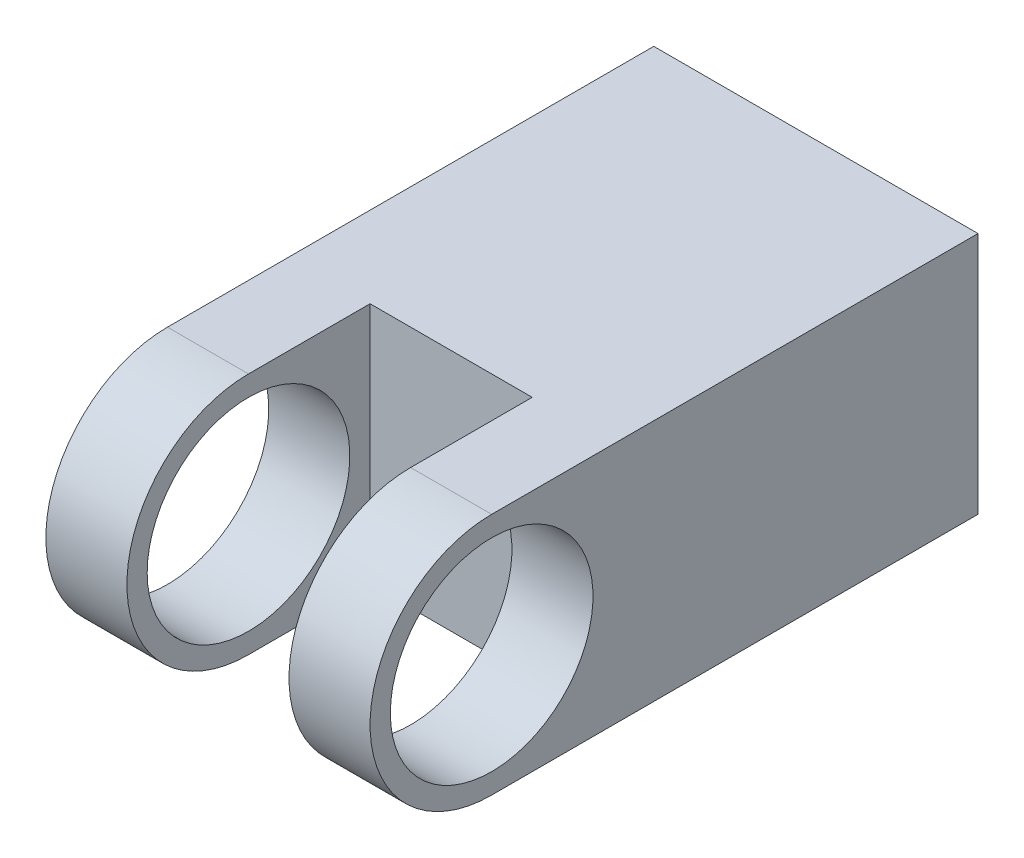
ISO-10303-21;
HEADER;
FILE_DESCRIPTION(('STEP AP214'),'2;1');
FILE_NAME('part.step','',(''),(''),'','','');
FILE_SCHEMA(('AUTOMOTIVE_DESIGN { 1 0 10303 214 1 1 1 1 }'));
ENDSEC;
DATA;
#1=APPLICATION_CONTEXT('core data for automotive mechanical design processes');
#2=APPLICATION_PROTOCOL_DEFINITION('international standard','automotive_design',2000,#1);
#3=PRODUCT_CONTEXT('',#1,'mechanical');
#4=PRODUCT('Part','Part','',(#3));
#5=PRODUCT_RELATED_PRODUCT_CATEGORY('part','',(#4));
#6=PRODUCT_DEFINITION_FORMATION('','',#4);
#7=PRODUCT_DEFINITION_CONTEXT('part definition',#1,'design');
#8=PRODUCT_DEFINITION('design','',#6,#7);
#9=PRODUCT_DEFINITION_SHAPE('','',#8);
#10=(LENGTH_UNIT() NAMED_UNIT(*) SI_UNIT(.MILLI.,.METRE.));
#11=(NAMED_UNIT(*) PLANE_ANGLE_UNIT() SI_UNIT($,.RADIAN.));
#12=(NAMED_UNIT(*) SI_UNIT($,.STERADIAN.) SOLID_ANGLE_UNIT());
#13=UNCERTAINTY_MEASURE_WITH_UNIT(LENGTH_MEASURE(1.E-05),#10,'distance_accuracy_value','');
#14=(GEOMETRIC_REPRESENTATION_CONTEXT(3) GLOBAL_UNCERTAINTY_ASSIGNED_CONTEXT((#13)) GLOBAL_UNIT_ASSIGNED_CONTEXT((#10,
#11,#12)) REPRESENTATION_CONTEXT('',''));
#15=CARTESIAN_POINT('',(0.,0.,0.));
#16=DIRECTION('',(0.,0.,1.));
#17=DIRECTION('',(1.,0.,0.));
#18=AXIS2_PLACEMENT_3D('',#15,#16,#17);
#19=CARTESIAN_POINT('',(0.,30.,0.));
#20=DIRECTION('',(1.,0.,0.));
#21=DIRECTION('',(0.,0.,-1.));
#22=AXIS2_PLACEMENT_3D('',#19,#20,#21);
#23=PLANE('',#22);
#24=DIRECTION('',(0.,0.,1.));
#25=VECTOR('',#24,1.);
#26=CARTESIAN_POINT('',(0.,0.,0.));
#27=LINE('',#26,#25);
#28=CARTESIAN_POINT('',(0.,0.,-45.));
#29=VERTEX_POINT('',#28);
#30=CARTESIAN_POINT('',(0.,0.,15.));
#31=VERTEX_POINT('',#30);
#32=EDGE_CURVE('E152',#29,#31,#27,.T.);
#33=ORIENTED_EDGE('',*,*,#32,.T.);
#34=CARTESIAN_POINT('',(0.,15.,15.));
#35=DIRECTION('',(-1.,0.,0.));
#36=DIRECTION('',(0.,0.,-1.));
#37=AXIS2_PLACEMENT_3D('',#34,#35,#36);
#38=CIRCLE('',#37,15.);
#39=CARTESIAN_POINT('',(0.,30.,15.));
#40=VERTEX_POINT('',#39);
#41=EDGE_CURVE('E133',#31,#40,#38,.T.);
#42=ORIENTED_EDGE('',*,*,#41,.T.);
#43=DIRECTION('',(0.,0.,1.));
#44=VECTOR('',#43,1.);
#45=CARTESIAN_POINT('',(0.,30.,0.));
#46=LINE('',#45,#44);
#47=CARTESIAN_POINT('',(0.,30.,-45.));
#48=VERTEX_POINT('',#47);
#49=EDGE_CURVE('E155',#48,#40,#46,.T.);
#50=ORIENTED_EDGE('',*,*,#49,.F.);
#51=DIRECTION('',(0.,-1.,0.));
#52=VECTOR('',#51,1.);
#53=CARTESIAN_POINT('',(0.,30.,-45.));
#54=LINE('',#53,#52);
#55=EDGE_CURVE('E40',#48,#29,#54,.T.);
#56=ORIENTED_EDGE('',*,*,#55,.T.);
#57=EDGE_LOOP('',(#33,#42,#50,#56));
#58=FACE_BOUND('',#57,.T.);
#59=CARTESIAN_POINT('',(0.,15.,15.));
#60=DIRECTION('',(-1.,0.,0.));
#61=DIRECTION('',(0.,0.,1.));
#62=AXIS2_PLACEMENT_3D('',#59,#60,#61);
#63=CIRCLE('',#62,12.5);
#64=CARTESIAN_POINT('',(0.,15.,27.5));
#65=VERTEX_POINT('',#64);
#66=EDGE_CURVE('E128',#65,#65,#63,.T.);
#67=ORIENTED_EDGE('',*,*,#66,.F.);
#68=EDGE_LOOP('',(#67));
#69=FACE_BOUND('',#68,.T.);
#70=ADVANCED_FACE('F33',(#58,#69),#23,.F.);
#71=CARTESIAN_POINT('',(0.,30.,0.));
#72=DIRECTION('',(0.,0.,-1.));
#73=DIRECTION('',(-1.,0.,0.));
#74=AXIS2_PLACEMENT_3D('',#71,#72,#73);
#75=PLANE('',#74);
#76=DIRECTION('',(1.,0.,0.));
#77=VECTOR('',#76,1.);
#78=CARTESIAN_POINT('',(0.,0.,0.));
#79=LINE('',#78,#77);
#80=CARTESIAN_POINT('',(10.,0.,0.));
#81=VERTEX_POINT('',#80);
#82=CARTESIAN_POINT('',(30.,0.,0.));
#83=VERTEX_POINT('',#82);
#84=EDGE_CURVE('E52',#81,#83,#79,.T.);
#85=ORIENTED_EDGE('',*,*,#84,.T.);
#86=DIRECTION('',(0.,-1.,0.));
#87=VECTOR('',#86,1.);
#88=CARTESIAN_POINT('',(30.,30.,0.));
#89=LINE('',#88,#87);
#90=CARTESIAN_POINT('',(30.,30.,0.));
#91=VERTEX_POINT('',#90);
#92=EDGE_CURVE('E47',#91,#83,#89,.T.);
#93=ORIENTED_EDGE('',*,*,#92,.F.);
#94=DIRECTION('',(1.,0.,0.));
#95=VECTOR('',#94,1.);
#96=CARTESIAN_POINT('',(0.,30.,0.));
#97=LINE('',#96,#95);
#98=CARTESIAN_POINT('',(10.,30.,0.));
#99=VERTEX_POINT('',#98);
#100=EDGE_CURVE('E120',#99,#91,#97,.T.);
#101=ORIENTED_EDGE('',*,*,#100,.F.);
#102=DIRECTION('',(0.,-1.,0.));
#103=VECTOR('',#102,1.);
#104=CARTESIAN_POINT('',(10.,30.,0.));
#105=LINE('',#104,#103);
#106=EDGE_CURVE('E136',#99,#81,#105,.T.);
#107=ORIENTED_EDGE('',*,*,#106,.T.);
#108=EDGE_LOOP('',(#85,#93,#101,#107));
#109=FACE_BOUND('',#108,.T.);
#110=ADVANCED_FACE('F189',(#109),#75,.F.);
#111=CARTESIAN_POINT('',(40.,30.,0.));
#112=DIRECTION('',(-1.,0.,0.));
#113=DIRECTION('',(0.,0.,1.));
#114=AXIS2_PLACEMENT_3D('',#111,#112,#113);
#115=PLANE('',#114);
#116=DIRECTION('',(0.,0.,-1.));
#117=VECTOR('',#116,1.);
#118=CARTESIAN_POINT('',(40.,0.,0.));
#119=LINE('',#118,#117);
#120=CARTESIAN_POINT('',(40.,0.,15.));
#121=VERTEX_POINT('',#120);
#122=CARTESIAN_POINT('',(40.,0.,-45.));
#123=VERTEX_POINT('',#122);
#124=EDGE_CURVE('E165',#121,#123,#119,.T.);
#125=ORIENTED_EDGE('',*,*,#124,.T.);
#126=DIRECTION('',(0.,-1.,0.));
#127=VECTOR('',#126,1.);
#128=CARTESIAN_POINT('',(40.,30.,-45.));
#129=LINE('',#128,#127);
#130=CARTESIAN_POINT('',(40.,30.,-45.));
#131=VERTEX_POINT('',#130);
#132=EDGE_CURVE('E11',#131,#123,#129,.T.);
#133=ORIENTED_EDGE('',*,*,#132,.F.);
#134=DIRECTION('',(0.,0.,-1.));
#135=VECTOR('',#134,1.);
#136=CARTESIAN_POINT('',(40.,30.,0.));
#137=LINE('',#136,#135);
#138=CARTESIAN_POINT('',(40.,30.,15.));
#139=VERTEX_POINT('',#138);
#140=EDGE_CURVE('E159',#139,#131,#137,.T.);
#141=ORIENTED_EDGE('',*,*,#140,.F.);
#142=CARTESIAN_POINT('',(40.,15.,15.));
#143=DIRECTION('',(-1.,0.,0.));
#144=DIRECTION('',(0.,0.,-1.));
#145=AXIS2_PLACEMENT_3D('',#142,#143,#144);
#146=CIRCLE('',#145,15.);
#147=EDGE_CURVE('E114',#121,#139,#146,.T.);
#148=ORIENTED_EDGE('',*,*,#147,.F.);
#149=EDGE_LOOP('',(#125,#133,#141,#148));
#150=FACE_BOUND('',#149,.T.);
#151=CARTESIAN_POINT('',(40.,15.,15.));
#152=DIRECTION('',(-1.,0.,0.));
#153=DIRECTION('',(0.,0.,1.));
#154=AXIS2_PLACEMENT_3D('',#151,#152,#153);
#155=CIRCLE('',#154,12.5);
#156=CARTESIAN_POINT('',(40.,15.,27.5));
#157=VERTEX_POINT('',#156);
#158=EDGE_CURVE('E193',#157,#157,#155,.T.);
#159=ORIENTED_EDGE('',*,*,#158,.T.);
#160=EDGE_LOOP('',(#159));
#161=FACE_BOUND('',#160,.T.);
#162=ADVANCED_FACE('F186',(#150,#161),#115,.F.);
#163=CARTESIAN_POINT('',(0.,30.,-45.));
#164=DIRECTION('',(0.,0.,1.));
#165=DIRECTION('',(1.,0.,0.));
#166=AXIS2_PLACEMENT_3D('',#163,#164,#165);
#167=PLANE('',#166);
#168=DIRECTION('',(-1.,0.,0.));
#169=VECTOR('',#168,1.);
#170=CARTESIAN_POINT('',(0.,0.,-45.));
#171=LINE('',#170,#169);
#172=EDGE_CURVE('E157',#123,#29,#171,.T.);
#173=ORIENTED_EDGE('',*,*,#172,.T.);
#174=ORIENTED_EDGE('',*,*,#55,.F.);
#175=DIRECTION('',(-1.,0.,0.));
#176=VECTOR('',#175,1.);
#177=CARTESIAN_POINT('',(0.,30.,-45.));
#178=LINE('',#177,#176);
#179=EDGE_CURVE('E161',#131,#48,#178,.T.);
#180=ORIENTED_EDGE('',*,*,#179,.F.);
#181=ORIENTED_EDGE('',*,*,#132,.T.);
#182=EDGE_LOOP('',(#173,#174,#180,#181));
#183=FACE_BOUND('',#182,.T.);
#184=ADVANCED_FACE('F184',(#183),#167,.F.);
#185=CARTESIAN_POINT('',(0.,30.,0.));
#186=DIRECTION('',(0.,-1.,0.));
#187=DIRECTION('',(0.,0.,-1.));
#188=AXIS2_PLACEMENT_3D('',#185,#186,#187);
#189=PLANE('',#188);
#190=ORIENTED_EDGE('',*,*,#49,.T.);
#191=DIRECTION('',(-1.,0.,0.));
#192=VECTOR('',#191,1.);
#193=CARTESIAN_POINT('',(10.,30.,15.));
#194=LINE('',#193,#192);
#195=CARTESIAN_POINT('',(10.,30.,15.));
#196=VERTEX_POINT('',#195);
#197=EDGE_CURVE('E149',#196,#40,#194,.T.);
#198=ORIENTED_EDGE('',*,*,#197,.F.);
#199=DIRECTION('',(0.,0.,-1.));
#200=VECTOR('',#199,1.);
#201=CARTESIAN_POINT('',(10.,30.,0.));
#202=LINE('',#201,#200);
#203=EDGE_CURVE('E144',#196,#99,#202,.T.);
#204=ORIENTED_EDGE('',*,*,#203,.T.);
#205=ORIENTED_EDGE('',*,*,#100,.T.);
#206=DIRECTION('',(0.,0.,-1.));
#207=VECTOR('',#206,1.);
#208=CARTESIAN_POINT('',(30.,30.,0.));
#209=LINE('',#208,#207);
#210=CARTESIAN_POINT('',(30.,30.,15.));
#211=VERTEX_POINT('',#210);
#212=EDGE_CURVE('E103',#211,#91,#209,.T.);
#213=ORIENTED_EDGE('',*,*,#212,.F.);
#214=DIRECTION('',(1.,0.,0.));
#215=VECTOR('',#214,1.);
#216=CARTESIAN_POINT('',(30.,30.,15.));
#217=LINE('',#216,#215);
#218=EDGE_CURVE('E111',#211,#139,#217,.T.);
#219=ORIENTED_EDGE('',*,*,#218,.T.);
#220=ORIENTED_EDGE('',*,*,#140,.T.);
#221=ORIENTED_EDGE('',*,*,#179,.T.);
#222=EDGE_LOOP('',(#190,#198,#204,#205,#213,#219,#220,#221));
#223=FACE_BOUND('',#222,.T.);
#224=ADVANCED_FACE('F118',(#223),#189,.F.);
#225=CARTESIAN_POINT('',(0.,0.,0.));
#226=DIRECTION('',(0.,-1.,0.));
#227=DIRECTION('',(0.,0.,-1.));
#228=AXIS2_PLACEMENT_3D('',#225,#226,#227);
#229=PLANE('',#228);
#230=ORIENTED_EDGE('',*,*,#32,.F.);
#231=ORIENTED_EDGE('',*,*,#172,.F.);
#232=ORIENTED_EDGE('',*,*,#124,.F.);
#233=DIRECTION('',(1.,0.,0.));
#234=VECTOR('',#233,1.);
#235=CARTESIAN_POINT('',(30.,0.,15.));
#236=LINE('',#235,#234);
#237=CARTESIAN_POINT('',(30.,0.,15.));
#238=VERTEX_POINT('',#237);
#239=EDGE_CURVE('E116',#238,#121,#236,.T.);
#240=ORIENTED_EDGE('',*,*,#239,.F.);
#241=DIRECTION('',(0.,0.,1.));
#242=VECTOR('',#241,1.);
#243=CARTESIAN_POINT('',(30.,0.,15.));
#244=LINE('',#243,#242);
#245=EDGE_CURVE('E104',#83,#238,#244,.T.);
#246=ORIENTED_EDGE('',*,*,#245,.F.);
#247=ORIENTED_EDGE('',*,*,#84,.F.);
#248=DIRECTION('',(0.,0.,1.));
#249=VECTOR('',#248,1.);
#250=CARTESIAN_POINT('',(10.,0.,15.));
#251=LINE('',#250,#249);
#252=CARTESIAN_POINT('',(10.,0.,15.));
#253=VERTEX_POINT('',#252);
#254=EDGE_CURVE('E138',#81,#253,#251,.T.);
#255=ORIENTED_EDGE('',*,*,#254,.T.);
#256=DIRECTION('',(-1.,0.,0.));
#257=VECTOR('',#256,1.);
#258=CARTESIAN_POINT('',(10.,0.,15.));
#259=LINE('',#258,#257);
#260=EDGE_CURVE('E146',#253,#31,#259,.T.);
#261=ORIENTED_EDGE('',*,*,#260,.T.);
#262=EDGE_LOOP('',(#230,#231,#232,#240,#246,#247,#255,#261));
#263=FACE_BOUND('',#262,.T.);
#264=ADVANCED_FACE('F177',(#263),#229,.T.);
#265=CARTESIAN_POINT('',(10.,15.,15.));
#266=DIRECTION('',(-1.,0.,0.));
#267=DIRECTION('',(0.,0.,1.));
#268=AXIS2_PLACEMENT_3D('',#265,#266,#267);
#269=CYLINDRICAL_SURFACE('',#268,15.);
#270=ORIENTED_EDGE('',*,*,#41,.F.);
#271=ORIENTED_EDGE('',*,*,#260,.F.);
#272=CARTESIAN_POINT('',(10.,15.,15.));
#273=DIRECTION('',(-1.,0.,0.));
#274=DIRECTION('',(0.,0.,-1.));
#275=AXIS2_PLACEMENT_3D('',#272,#273,#274);
#276=CIRCLE('',#275,15.);
#277=EDGE_CURVE('E141',#253,#196,#276,.T.);
#278=ORIENTED_EDGE('',*,*,#277,.T.);
#279=ORIENTED_EDGE('',*,*,#197,.T.);
#280=EDGE_LOOP('',(#270,#271,#278,#279));
#281=FACE_BOUND('',#280,.T.);
#282=ADVANCED_FACE('F181',(#281),#269,.T.);
#283=CARTESIAN_POINT('',(10.,15.,15.));
#284=DIRECTION('',(1.,0.,0.));
#285=DIRECTION('',(0.,0.,-1.));
#286=AXIS2_PLACEMENT_3D('',#283,#284,#285);
#287=PLANE('',#286);
#288=CARTESIAN_POINT('',(10.,15.,15.));
#289=DIRECTION('',(-1.,0.,0.));
#290=DIRECTION('',(0.,0.,1.));
#291=AXIS2_PLACEMENT_3D('',#288,#289,#290);
#292=CIRCLE('',#291,12.5);
#293=CARTESIAN_POINT('',(10.,15.,27.5));
#294=VERTEX_POINT('',#293);
#295=EDGE_CURVE('E130',#294,#294,#292,.T.);
#296=ORIENTED_EDGE('',*,*,#295,.T.);
#297=EDGE_LOOP('',(#296));
#298=FACE_BOUND('',#297,.T.);
#299=ORIENTED_EDGE('',*,*,#106,.F.);
#300=ORIENTED_EDGE('',*,*,#203,.F.);
#301=ORIENTED_EDGE('',*,*,#277,.F.);
#302=ORIENTED_EDGE('',*,*,#254,.F.);
#303=EDGE_LOOP('',(#299,#300,#301,#302));
#304=FACE_BOUND('',#303,.T.);
#305=ADVANCED_FACE('F208',(#298,#304),#287,.T.);
#306=CARTESIAN_POINT('',(10.,15.,15.));
#307=DIRECTION('',(-1.,0.,0.));
#308=DIRECTION('',(0.,0.,1.));
#309=AXIS2_PLACEMENT_3D('',#306,#307,#308);
#310=CYLINDRICAL_SURFACE('',#309,12.5);
#311=ORIENTED_EDGE('',*,*,#295,.F.);
#312=EDGE_LOOP('',(#311));
#313=FACE_BOUND('',#312,.T.);
#314=ORIENTED_EDGE('',*,*,#66,.T.);
#315=EDGE_LOOP('',(#314));
#316=FACE_BOUND('',#315,.T.);
#317=ADVANCED_FACE('F201',(#313,#316),#310,.F.);
#318=CARTESIAN_POINT('',(30.,15.,15.));
#319=DIRECTION('',(-1.,0.,0.));
#320=DIRECTION('',(0.,0.,-1.));
#321=AXIS2_PLACEMENT_3D('',#318,#319,#320);
#322=PLANE('',#321);
#323=ORIENTED_EDGE('',*,*,#92,.T.);
#324=ORIENTED_EDGE('',*,*,#245,.T.);
#325=CARTESIAN_POINT('',(30.,15.,15.));
#326=DIRECTION('',(-1.,0.,0.));
#327=DIRECTION('',(0.,0.,-1.));
#328=AXIS2_PLACEMENT_3D('',#325,#326,#327);
#329=CIRCLE('',#328,15.);
#330=EDGE_CURVE('E98',#238,#211,#329,.T.);
#331=ORIENTED_EDGE('',*,*,#330,.T.);
#332=ORIENTED_EDGE('',*,*,#212,.T.);
#333=EDGE_LOOP('',(#323,#324,#331,#332));
#334=FACE_BOUND('',#333,.T.);
#335=CARTESIAN_POINT('',(30.,15.,15.));
#336=DIRECTION('',(-1.,0.,0.));
#337=DIRECTION('',(0.,0.,1.));
#338=AXIS2_PLACEMENT_3D('',#335,#336,#337);
#339=CIRCLE('',#338,12.5);
#340=CARTESIAN_POINT('',(30.,15.,27.5));
#341=VERTEX_POINT('',#340);
#342=EDGE_CURVE('E127',#341,#341,#339,.T.);
#343=ORIENTED_EDGE('',*,*,#342,.F.);
#344=EDGE_LOOP('',(#343));
#345=FACE_BOUND('',#344,.T.);
#346=ADVANCED_FACE('F100',(#334,#345),#322,.T.);
#347=CARTESIAN_POINT('',(30.,15.,15.));
#348=DIRECTION('',(1.,0.,0.));
#349=DIRECTION('',(0.,0.,-1.));
#350=AXIS2_PLACEMENT_3D('',#347,#348,#349);
#351=CYLINDRICAL_SURFACE('',#350,15.);
#352=ORIENTED_EDGE('',*,*,#147,.T.);
#353=ORIENTED_EDGE('',*,*,#218,.F.);
#354=ORIENTED_EDGE('',*,*,#330,.F.);
#355=ORIENTED_EDGE('',*,*,#239,.T.);
#356=EDGE_LOOP('',(#352,#353,#354,#355));
#357=FACE_BOUND('',#356,.T.);
#358=ADVANCED_FACE('F112',(#357),#351,.T.);
#359=CARTESIAN_POINT('',(30.,15.,15.));
#360=DIRECTION('',(1.,0.,0.));
#361=DIRECTION('',(0.,0.,-1.));
#362=AXIS2_PLACEMENT_3D('',#359,#360,#361);
#363=CYLINDRICAL_SURFACE('',#362,12.5);
#364=ORIENTED_EDGE('',*,*,#342,.T.);
#365=EDGE_LOOP('',(#364));
#366=FACE_BOUND('',#365,.T.);
#367=ORIENTED_EDGE('',*,*,#158,.F.);
#368=EDGE_LOOP('',(#367));
#369=FACE_BOUND('',#368,.T.);
#370=ADVANCED_FACE('F199',(#366,#369),#363,.F.);
#371=CLOSED_SHELL('',(#70,#110,#162,#184,#224,#264,#282,#305,#317,#346,#358,#370));
#372=MANIFOLD_SOLID_BREP('B2',#371);
#373=ADVANCED_BREP_SHAPE_REPRESENTATION('',(#18,#372),#14);
#374=SHAPE_DEFINITION_REPRESENTATION(#9,#373);
ENDSEC;
END-ISO-10303-21;
